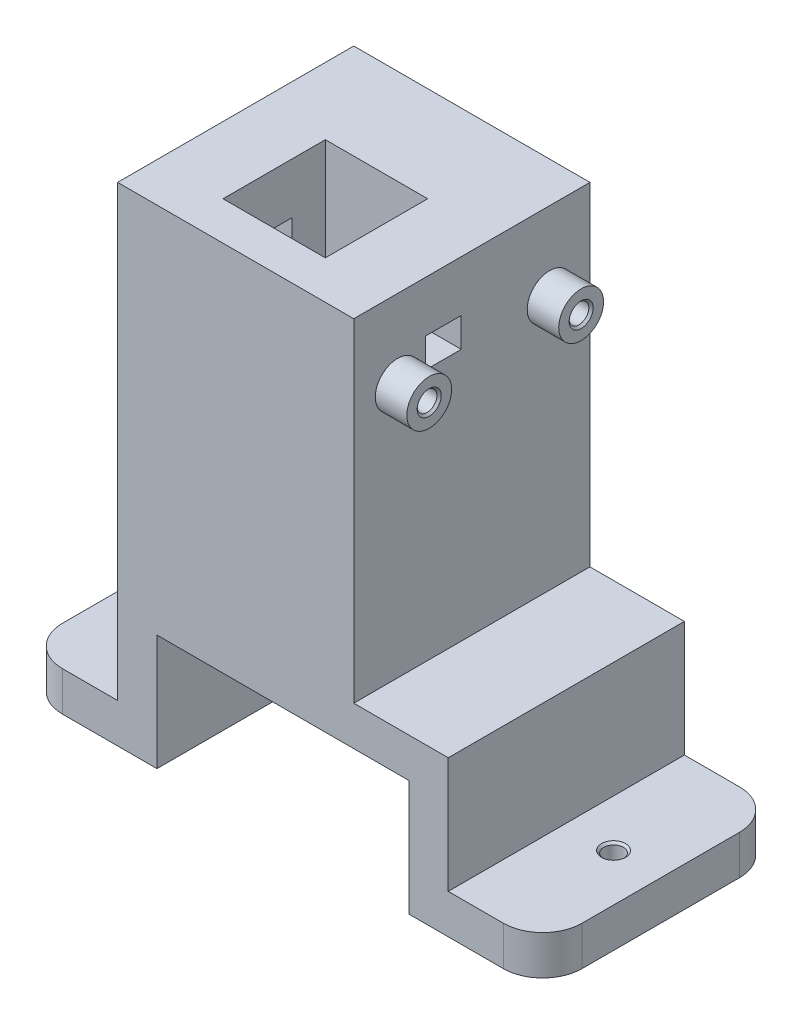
ISO-10303-21;
HEADER;
FILE_DESCRIPTION(('STEP AP214'),'2;1');
FILE_NAME('part.step','',(''),(''),'','','');
FILE_SCHEMA(('AUTOMOTIVE_DESIGN { 1 0 10303 214 1 1 1 1 }'));
ENDSEC;
DATA;
#1=APPLICATION_CONTEXT('core data for automotive mechanical design processes');
#2=APPLICATION_PROTOCOL_DEFINITION('international standard','automotive_design',2000,#1);
#3=PRODUCT_CONTEXT('',#1,'mechanical');
#4=PRODUCT('Part','Part','',(#3));
#5=PRODUCT_RELATED_PRODUCT_CATEGORY('part','',(#4));
#6=PRODUCT_DEFINITION_FORMATION('','',#4);
#7=PRODUCT_DEFINITION_CONTEXT('part definition',#1,'design');
#8=PRODUCT_DEFINITION('design','',#6,#7);
#9=PRODUCT_DEFINITION_SHAPE('','',#8);
#10=(LENGTH_UNIT() NAMED_UNIT(*) SI_UNIT(.MILLI.,.METRE.));
#11=(NAMED_UNIT(*) PLANE_ANGLE_UNIT() SI_UNIT($,.RADIAN.));
#12=(NAMED_UNIT(*) SI_UNIT($,.STERADIAN.) SOLID_ANGLE_UNIT());
#13=UNCERTAINTY_MEASURE_WITH_UNIT(LENGTH_MEASURE(1.E-05),#10,'distance_accuracy_value','');
#14=(GEOMETRIC_REPRESENTATION_CONTEXT(3) GLOBAL_UNCERTAINTY_ASSIGNED_CONTEXT((#13)) GLOBAL_UNIT_ASSIGNED_CONTEXT((#10,
#11,#12)) REPRESENTATION_CONTEXT('',''));
#15=CARTESIAN_POINT('',(0.,0.,0.));
#16=DIRECTION('',(0.,0.,1.));
#17=DIRECTION('',(1.,0.,0.));
#18=AXIS2_PLACEMENT_3D('',#15,#16,#17);
#19=CARTESIAN_POINT('',(-17.5352823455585,24.5628506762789,30.));
#20=DIRECTION('',(1.,0.,0.));
#21=DIRECTION('',(0.,1.,0.));
#22=AXIS2_PLACEMENT_3D('',#19,#20,#21);
#23=PLANE('',#22);
#24=DIRECTION('',(0.,0.,-1.));
#25=VECTOR('',#24,1.);
#26=CARTESIAN_POINT('',(-17.5352823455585,18.0992984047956,30.));
#27=LINE('',#26,#25);
#28=CARTESIAN_POINT('',(-17.5352823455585,18.0992984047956,20.8723608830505));
#29=VERTEX_POINT('',#28);
#30=CARTESIAN_POINT('',(-17.5352823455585,18.0992984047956,16.3476391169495));
#31=VERTEX_POINT('',#30);
#32=EDGE_CURVE('E332',#29,#31,#27,.T.);
#33=ORIENTED_EDGE('',*,*,#32,.F.);
#34=DIRECTION('',(0.,-1.,0.));
#35=VECTOR('',#34,1.);
#36=CARTESIAN_POINT('',(-17.5352823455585,24.5628506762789,20.8723608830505));
#37=LINE('',#36,#35);
#38=CARTESIAN_POINT('',(-17.5352823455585,14.3664029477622,20.8723608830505));
#39=VERTEX_POINT('',#38);
#40=EDGE_CURVE('E337',#29,#39,#37,.T.);
#41=ORIENTED_EDGE('',*,*,#40,.T.);
#42=DIRECTION('',(0.,0.,-1.));
#43=VECTOR('',#42,1.);
#44=CARTESIAN_POINT('',(-17.5352823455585,14.3664029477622,30.));
#45=LINE('',#44,#43);
#46=CARTESIAN_POINT('',(-17.5352823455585,14.3664029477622,16.3476391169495));
#47=VERTEX_POINT('',#46);
#48=EDGE_CURVE('E321',#39,#47,#45,.T.);
#49=ORIENTED_EDGE('',*,*,#48,.T.);
#50=DIRECTION('',(0.,-1.,0.));
#51=VECTOR('',#50,1.);
#52=CARTESIAN_POINT('',(-17.5352823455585,24.5628506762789,16.3476391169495));
#53=LINE('',#52,#51);
#54=EDGE_CURVE('E327',#31,#47,#53,.T.);
#55=ORIENTED_EDGE('',*,*,#54,.F.);
#56=EDGE_LOOP('',(#33,#41,#49,#55));
#57=FACE_BOUND('',#56,.T.);
#58=DIRECTION('',(0.,-1.,0.));
#59=VECTOR('',#58,1.);
#60=CARTESIAN_POINT('',(-17.5352823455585,24.5628506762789,0.));
#61=LINE('',#60,#59);
#62=CARTESIAN_POINT('',(-17.5352823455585,24.5628506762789,0.));
#63=VERTEX_POINT('',#62);
#64=CARTESIAN_POINT('',(-17.5352823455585,-32.4371493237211,0.));
#65=VERTEX_POINT('',#64);
#66=EDGE_CURVE('E378',#63,#65,#61,.T.);
#67=ORIENTED_EDGE('',*,*,#66,.T.);
#68=DIRECTION('',(0.,0.,-1.));
#69=VECTOR('',#68,1.);
#70=CARTESIAN_POINT('',(-17.5352823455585,-32.4371493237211,30.));
#71=LINE('',#70,#69);
#72=CARTESIAN_POINT('',(-17.5352823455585,-32.4371493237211,30.));
#73=VERTEX_POINT('',#72);
#74=EDGE_CURVE('E469',#73,#65,#71,.T.);
#75=ORIENTED_EDGE('',*,*,#74,.F.);
#76=DIRECTION('',(0.,-1.,0.));
#77=VECTOR('',#76,1.);
#78=CARTESIAN_POINT('',(-17.5352823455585,24.5628506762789,30.));
#79=LINE('',#78,#77);
#80=CARTESIAN_POINT('',(-17.5352823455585,24.5628506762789,30.));
#81=VERTEX_POINT('',#80);
#82=EDGE_CURVE('E379',#81,#73,#79,.T.);
#83=ORIENTED_EDGE('',*,*,#82,.F.);
#84=DIRECTION('',(0.,0.,-1.));
#85=VECTOR('',#84,1.);
#86=CARTESIAN_POINT('',(-17.5352823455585,24.5628506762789,30.));
#87=LINE('',#86,#85);
#88=EDGE_CURVE('E407',#81,#63,#87,.T.);
#89=ORIENTED_EDGE('',*,*,#88,.T.);
#90=EDGE_LOOP('',(#67,#75,#83,#89));
#91=FACE_BOUND('',#90,.T.);
#92=ADVANCED_FACE('F49',(#57,#91),#23,.F.);
#93=CARTESIAN_POINT('',(-17.5352823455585,-32.4371493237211,30.));
#94=DIRECTION('',(0.,-1.,0.));
#95=DIRECTION('',(1.,0.,0.));
#96=AXIS2_PLACEMENT_3D('',#93,#94,#95);
#97=PLANE('',#96);
#98=CARTESIAN_POINT('',(-23.5352823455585,-32.4371493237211,15.));
#99=DIRECTION('',(0.,1.,0.));
#100=DIRECTION('',(0.,0.,1.));
#101=AXIS2_PLACEMENT_3D('',#98,#99,#100);
#102=CIRCLE('',#101,1.525);
#103=CARTESIAN_POINT('',(-23.5352823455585,-32.4371493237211,16.525));
#104=VERTEX_POINT('',#103);
#105=EDGE_CURVE('E276',#104,#104,#102,.T.);
#106=ORIENTED_EDGE('',*,*,#105,.F.);
#107=EDGE_LOOP('',(#106));
#108=FACE_BOUND('',#107,.T.);
#109=DIRECTION('',(0.,0.,-1.));
#110=VECTOR('',#109,1.);
#111=CARTESIAN_POINT('',(-29.5352823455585,-32.4371493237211,30.));
#112=LINE('',#111,#110);
#113=CARTESIAN_POINT('',(-29.5352823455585,-32.4371493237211,25.));
#114=VERTEX_POINT('',#113);
#115=CARTESIAN_POINT('',(-29.5352823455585,-32.4371493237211,5.));
#116=VERTEX_POINT('',#115);
#117=EDGE_CURVE('E467',#114,#116,#112,.T.);
#118=ORIENTED_EDGE('',*,*,#117,.F.);
#119=CARTESIAN_POINT('',(-24.5352823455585,-32.4371493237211,25.));
#120=DIRECTION('',(0.,-1.,0.));
#121=DIRECTION('',(1.,0.,0.));
#122=AXIS2_PLACEMENT_3D('',#119,#120,#121);
#123=CIRCLE('',#122,5.);
#124=CARTESIAN_POINT('',(-24.5352823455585,-32.4371493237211,30.));
#125=VERTEX_POINT('',#124);
#126=EDGE_CURVE('E11',#114,#125,#123,.F.);
#127=ORIENTED_EDGE('',*,*,#126,.T.);
#128=DIRECTION('',(-1.,0.,0.));
#129=VECTOR('',#128,1.);
#130=CARTESIAN_POINT('',(-17.5352823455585,-32.4371493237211,30.));
#131=LINE('',#130,#129);
#132=EDGE_CURVE('E382',#73,#125,#131,.T.);
#133=ORIENTED_EDGE('',*,*,#132,.F.);
#134=ORIENTED_EDGE('',*,*,#74,.T.);
#135=DIRECTION('',(-1.,0.,0.));
#136=VECTOR('',#135,1.);
#137=CARTESIAN_POINT('',(-17.5352823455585,-32.4371493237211,0.));
#138=LINE('',#137,#136);
#139=CARTESIAN_POINT('',(-24.5352823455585,-32.4371493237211,0.));
#140=VERTEX_POINT('',#139);
#141=EDGE_CURVE('E410',#65,#140,#138,.T.);
#142=ORIENTED_EDGE('',*,*,#141,.T.);
#143=CARTESIAN_POINT('',(-24.5352823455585,-32.4371493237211,5.));
#144=DIRECTION('',(0.,-1.,0.));
#145=DIRECTION('',(1.,0.,0.));
#146=AXIS2_PLACEMENT_3D('',#143,#144,#145);
#147=CIRCLE('',#146,5.);
#148=EDGE_CURVE('E57',#140,#116,#147,.F.);
#149=ORIENTED_EDGE('',*,*,#148,.T.);
#150=EDGE_LOOP('',(#118,#127,#133,#134,#142,#149));
#151=FACE_BOUND('',#150,.T.);
#152=ADVANCED_FACE('F534',(#108,#151),#97,.F.);
#153=CARTESIAN_POINT('',(-29.5352823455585,-32.4371493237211,30.));
#154=DIRECTION('',(1.,0.,0.));
#155=DIRECTION('',(0.,0.,-1.));
#156=AXIS2_PLACEMENT_3D('',#153,#154,#155);
#157=PLANE('',#156);
#158=DIRECTION('',(0.,0.,-1.));
#159=VECTOR('',#158,1.);
#160=CARTESIAN_POINT('',(-29.5352823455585,-37.4371493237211,30.));
#161=LINE('',#160,#159);
#162=CARTESIAN_POINT('',(-29.5352823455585,-37.4371493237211,25.));
#163=VERTEX_POINT('',#162);
#164=CARTESIAN_POINT('',(-29.5352823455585,-37.4371493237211,5.));
#165=VERTEX_POINT('',#164);
#166=EDGE_CURVE('E464',#163,#165,#161,.T.);
#167=ORIENTED_EDGE('',*,*,#166,.F.);
#168=DIRECTION('',(0.,-1.,0.));
#169=VECTOR('',#168,1.);
#170=CARTESIAN_POINT('',(-29.5352823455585,-32.4371493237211,25.));
#171=LINE('',#170,#169);
#172=EDGE_CURVE('E70',#163,#114,#171,.F.);
#173=ORIENTED_EDGE('',*,*,#172,.T.);
#174=ORIENTED_EDGE('',*,*,#117,.T.);
#175=DIRECTION('',(0.,-1.,0.));
#176=VECTOR('',#175,1.);
#177=CARTESIAN_POINT('',(-29.5352823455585,-37.4371493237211,5.));
#178=LINE('',#177,#176);
#179=EDGE_CURVE('E515',#116,#165,#178,.T.);
#180=ORIENTED_EDGE('',*,*,#179,.T.);
#181=EDGE_LOOP('',(#167,#173,#174,#180));
#182=FACE_BOUND('',#181,.T.);
#183=ADVANCED_FACE('F519',(#182),#157,.F.);
#184=CARTESIAN_POINT('',(-29.5352823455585,-37.4371493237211,30.));
#185=DIRECTION('',(0.,1.,0.));
#186=DIRECTION('',(-1.,0.,0.));
#187=AXIS2_PLACEMENT_3D('',#184,#185,#186);
#188=PLANE('',#187);
#189=CARTESIAN_POINT('',(-23.5352823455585,-37.4371493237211,15.));
#190=DIRECTION('',(0.,1.,0.));
#191=DIRECTION('',(0.,0.,1.));
#192=AXIS2_PLACEMENT_3D('',#189,#190,#191);
#193=CIRCLE('',#192,1.25);
#194=CARTESIAN_POINT('',(-23.5352823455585,-37.4371493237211,16.25));
#195=VERTEX_POINT('',#194);
#196=EDGE_CURVE('E282',#195,#195,#193,.T.);
#197=ORIENTED_EDGE('',*,*,#196,.T.);
#198=EDGE_LOOP('',(#197));
#199=FACE_BOUND('',#198,.T.);
#200=DIRECTION('',(1.,0.,0.));
#201=VECTOR('',#200,1.);
#202=CARTESIAN_POINT('',(-29.5352823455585,-37.4371493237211,30.));
#203=LINE('',#202,#201);
#204=CARTESIAN_POINT('',(-24.5352823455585,-37.4371493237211,30.));
#205=VERTEX_POINT('',#204);
#206=CARTESIAN_POINT('',(-12.5352823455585,-37.4371493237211,30.));
#207=VERTEX_POINT('',#206);
#208=EDGE_CURVE('E386',#205,#207,#203,.T.);
#209=ORIENTED_EDGE('',*,*,#208,.F.);
#210=CARTESIAN_POINT('',(-24.5352823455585,-37.4371493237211,25.));
#211=DIRECTION('',(0.,1.,0.));
#212=DIRECTION('',(-1.,0.,0.));
#213=AXIS2_PLACEMENT_3D('',#210,#211,#212);
#214=CIRCLE('',#213,5.);
#215=EDGE_CURVE('E513',#205,#163,#214,.F.);
#216=ORIENTED_EDGE('',*,*,#215,.T.);
#217=ORIENTED_EDGE('',*,*,#166,.T.);
#218=CARTESIAN_POINT('',(-24.5352823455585,-37.4371493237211,5.));
#219=DIRECTION('',(0.,1.,0.));
#220=DIRECTION('',(-1.,0.,0.));
#221=AXIS2_PLACEMENT_3D('',#218,#219,#220);
#222=CIRCLE('',#221,5.);
#223=CARTESIAN_POINT('',(-24.5352823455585,-37.4371493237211,0.));
#224=VERTEX_POINT('',#223);
#225=EDGE_CURVE('E511',#165,#224,#222,.F.);
#226=ORIENTED_EDGE('',*,*,#225,.T.);
#227=DIRECTION('',(1.,0.,0.));
#228=VECTOR('',#227,1.);
#229=CARTESIAN_POINT('',(-29.5352823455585,-37.4371493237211,0.));
#230=LINE('',#229,#228);
#231=CARTESIAN_POINT('',(-12.5352823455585,-37.4371493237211,0.));
#232=VERTEX_POINT('',#231);
#233=EDGE_CURVE('E412',#224,#232,#230,.T.);
#234=ORIENTED_EDGE('',*,*,#233,.T.);
#235=DIRECTION('',(0.,0.,-1.));
#236=VECTOR('',#235,1.);
#237=CARTESIAN_POINT('',(-12.5352823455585,-37.4371493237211,30.));
#238=LINE('',#237,#236);
#239=EDGE_CURVE('E461',#207,#232,#238,.T.);
#240=ORIENTED_EDGE('',*,*,#239,.F.);
#241=EDGE_LOOP('',(#209,#216,#217,#226,#234,#240));
#242=FACE_BOUND('',#241,.T.);
#243=ADVANCED_FACE('F523',(#199,#242),#188,.F.);
#244=CARTESIAN_POINT('',(-12.5352823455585,-37.4371493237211,30.));
#245=DIRECTION('',(-1.,0.,0.));
#246=DIRECTION('',(0.,-1.,0.));
#247=AXIS2_PLACEMENT_3D('',#244,#245,#246);
#248=PLANE('',#247);
#249=DIRECTION('',(0.,1.,0.));
#250=VECTOR('',#249,1.);
#251=CARTESIAN_POINT('',(-12.5352823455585,-37.4371493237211,0.));
#252=LINE('',#251,#250);
#253=CARTESIAN_POINT('',(-12.5352823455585,-22.7371493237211,0.));
#254=VERTEX_POINT('',#253);
#255=EDGE_CURVE('E414',#232,#254,#252,.T.);
#256=ORIENTED_EDGE('',*,*,#255,.T.);
#257=DIRECTION('',(0.,0.,-1.));
#258=VECTOR('',#257,1.);
#259=CARTESIAN_POINT('',(-12.5352823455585,-22.7371493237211,30.));
#260=LINE('',#259,#258);
#261=CARTESIAN_POINT('',(-12.5352823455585,-22.7371493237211,30.));
#262=VERTEX_POINT('',#261);
#263=EDGE_CURVE('E458',#262,#254,#260,.T.);
#264=ORIENTED_EDGE('',*,*,#263,.F.);
#265=DIRECTION('',(0.,1.,0.));
#266=VECTOR('',#265,1.);
#267=CARTESIAN_POINT('',(-12.5352823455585,-37.4371493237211,30.));
#268=LINE('',#267,#266);
#269=EDGE_CURVE('E388',#207,#262,#268,.T.);
#270=ORIENTED_EDGE('',*,*,#269,.F.);
#271=ORIENTED_EDGE('',*,*,#239,.T.);
#272=EDGE_LOOP('',(#256,#264,#270,#271));
#273=FACE_BOUND('',#272,.T.);
#274=ADVANCED_FACE('F646',(#273),#248,.F.);
#275=CARTESIAN_POINT('',(-12.5352823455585,-22.7371493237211,30.));
#276=DIRECTION('',(0.,1.,0.));
#277=DIRECTION('',(-1.,0.,0.));
#278=AXIS2_PLACEMENT_3D('',#275,#276,#277);
#279=PLANE('',#278);
#280=DIRECTION('',(1.,0.,0.));
#281=VECTOR('',#280,1.);
#282=CARTESIAN_POINT('',(-12.5352823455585,-22.7371493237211,0.));
#283=LINE('',#282,#281);
#284=CARTESIAN_POINT('',(19.4647176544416,-22.7371493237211,0.));
#285=VERTEX_POINT('',#284);
#286=EDGE_CURVE('E416',#254,#285,#283,.T.);
#287=ORIENTED_EDGE('',*,*,#286,.T.);
#288=DIRECTION('',(0.,0.,-1.));
#289=VECTOR('',#288,1.);
#290=CARTESIAN_POINT('',(19.4647176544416,-22.7371493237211,30.));
#291=LINE('',#290,#289);
#292=CARTESIAN_POINT('',(19.4647176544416,-22.7371493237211,30.));
#293=VERTEX_POINT('',#292);
#294=EDGE_CURVE('E455',#293,#285,#291,.T.);
#295=ORIENTED_EDGE('',*,*,#294,.F.);
#296=DIRECTION('',(1.,0.,0.));
#297=VECTOR('',#296,1.);
#298=CARTESIAN_POINT('',(-12.5352823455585,-22.7371493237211,30.));
#299=LINE('',#298,#297);
#300=EDGE_CURVE('E390',#262,#293,#299,.T.);
#301=ORIENTED_EDGE('',*,*,#300,.F.);
#302=ORIENTED_EDGE('',*,*,#263,.T.);
#303=EDGE_LOOP('',(#287,#295,#301,#302));
#304=FACE_BOUND('',#303,.T.);
#305=ADVANCED_FACE('F643',(#304),#279,.F.);
#306=CARTESIAN_POINT('',(19.4647176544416,-37.4371493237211,30.));
#307=DIRECTION('',(1.,0.,0.));
#308=DIRECTION('',(0.,0.,-1.));
#309=AXIS2_PLACEMENT_3D('',#306,#307,#308);
#310=PLANE('',#309);
#311=DIRECTION('',(0.,-1.,0.));
#312=VECTOR('',#311,1.);
#313=CARTESIAN_POINT('',(19.4647176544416,-37.4371493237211,0.));
#314=LINE('',#313,#312);
#315=CARTESIAN_POINT('',(19.4647176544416,-37.4371493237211,0.));
#316=VERTEX_POINT('',#315);
#317=EDGE_CURVE('E418',#285,#316,#314,.T.);
#318=ORIENTED_EDGE('',*,*,#317,.T.);
#319=DIRECTION('',(0.,0.,-1.));
#320=VECTOR('',#319,1.);
#321=CARTESIAN_POINT('',(19.4647176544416,-37.4371493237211,30.));
#322=LINE('',#321,#320);
#323=CARTESIAN_POINT('',(19.4647176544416,-37.4371493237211,30.));
#324=VERTEX_POINT('',#323);
#325=EDGE_CURVE('E452',#324,#316,#322,.T.);
#326=ORIENTED_EDGE('',*,*,#325,.F.);
#327=DIRECTION('',(0.,-1.,0.));
#328=VECTOR('',#327,1.);
#329=CARTESIAN_POINT('',(19.4647176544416,-37.4371493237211,30.));
#330=LINE('',#329,#328);
#331=EDGE_CURVE('E392',#293,#324,#330,.T.);
#332=ORIENTED_EDGE('',*,*,#331,.F.);
#333=ORIENTED_EDGE('',*,*,#294,.T.);
#334=EDGE_LOOP('',(#318,#326,#332,#333));
#335=FACE_BOUND('',#334,.T.);
#336=ADVANCED_FACE('F585',(#335),#310,.F.);
#337=CARTESIAN_POINT('',(19.4647176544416,-37.4371493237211,30.));
#338=DIRECTION('',(0.,1.,0.));
#339=DIRECTION('',(0.,0.,1.));
#340=AXIS2_PLACEMENT_3D('',#337,#338,#339);
#341=PLANE('',#340);
#342=CARTESIAN_POINT('',(30.4647176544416,-37.4371493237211,15.));
#343=DIRECTION('',(0.,1.,0.));
#344=DIRECTION('',(0.,0.,1.));
#345=AXIS2_PLACEMENT_3D('',#342,#343,#344);
#346=CIRCLE('',#345,1.25);
#347=CARTESIAN_POINT('',(30.4647176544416,-37.4371493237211,16.25));
#348=VERTEX_POINT('',#347);
#349=EDGE_CURVE('E291',#348,#348,#346,.T.);
#350=ORIENTED_EDGE('',*,*,#349,.T.);
#351=EDGE_LOOP('',(#350));
#352=FACE_BOUND('',#351,.T.);
#353=DIRECTION('',(1.,0.,0.));
#354=VECTOR('',#353,1.);
#355=CARTESIAN_POINT('',(19.4647176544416,-37.4371493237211,0.));
#356=LINE('',#355,#354);
#357=CARTESIAN_POINT('',(31.4647176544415,-37.4371493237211,0.));
#358=VERTEX_POINT('',#357);
#359=EDGE_CURVE('E420',#316,#358,#356,.T.);
#360=ORIENTED_EDGE('',*,*,#359,.T.);
#361=CARTESIAN_POINT('',(31.4647176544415,-37.4371493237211,5.));
#362=DIRECTION('',(0.,1.,0.));
#363=DIRECTION('',(0.,0.,1.));
#364=AXIS2_PLACEMENT_3D('',#361,#362,#363);
#365=CIRCLE('',#364,5.);
#366=CARTESIAN_POINT('',(36.4647176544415,-37.4371493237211,5.));
#367=VERTEX_POINT('',#366);
#368=EDGE_CURVE('E503',#358,#367,#365,.F.);
#369=ORIENTED_EDGE('',*,*,#368,.T.);
#370=DIRECTION('',(0.,0.,-1.));
#371=VECTOR('',#370,1.);
#372=CARTESIAN_POINT('',(36.4647176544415,-37.4371493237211,30.));
#373=LINE('',#372,#371);
#374=CARTESIAN_POINT('',(36.4647176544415,-37.4371493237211,25.));
#375=VERTEX_POINT('',#374);
#376=EDGE_CURVE('E449',#375,#367,#373,.T.);
#377=ORIENTED_EDGE('',*,*,#376,.F.);
#378=CARTESIAN_POINT('',(31.4647176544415,-37.4371493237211,25.));
#379=DIRECTION('',(0.,1.,0.));
#380=DIRECTION('',(0.,0.,1.));
#381=AXIS2_PLACEMENT_3D('',#378,#379,#380);
#382=CIRCLE('',#381,5.);
#383=CARTESIAN_POINT('',(31.4647176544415,-37.4371493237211,30.));
#384=VERTEX_POINT('',#383);
#385=EDGE_CURVE('E501',#375,#384,#382,.F.);
#386=ORIENTED_EDGE('',*,*,#385,.T.);
#387=DIRECTION('',(1.,0.,0.));
#388=VECTOR('',#387,1.);
#389=CARTESIAN_POINT('',(19.4647176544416,-37.4371493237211,30.));
#390=LINE('',#389,#388);
#391=EDGE_CURVE('E394',#324,#384,#390,.T.);
#392=ORIENTED_EDGE('',*,*,#391,.F.);
#393=ORIENTED_EDGE('',*,*,#325,.T.);
#394=EDGE_LOOP('',(#360,#369,#377,#386,#392,#393));
#395=FACE_BOUND('',#394,.T.);
#396=ADVANCED_FACE('F578',(#352,#395),#341,.F.);
#397=CARTESIAN_POINT('',(36.4647176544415,-32.4371493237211,30.));
#398=DIRECTION('',(-1.,0.,0.));
#399=DIRECTION('',(0.,0.,1.));
#400=AXIS2_PLACEMENT_3D('',#397,#398,#399);
#401=PLANE('',#400);
#402=ORIENTED_EDGE('',*,*,#376,.T.);
#403=DIRECTION('',(0.,1.,0.));
#404=VECTOR('',#403,1.);
#405=CARTESIAN_POINT('',(36.4647176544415,-32.4371493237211,5.));
#406=LINE('',#405,#404);
#407=CARTESIAN_POINT('',(36.4647176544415,-32.4371493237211,5.));
#408=VERTEX_POINT('',#407);
#409=EDGE_CURVE('E490',#367,#408,#406,.T.);
#410=ORIENTED_EDGE('',*,*,#409,.T.);
#411=DIRECTION('',(0.,0.,-1.));
#412=VECTOR('',#411,1.);
#413=CARTESIAN_POINT('',(36.4647176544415,-32.4371493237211,30.));
#414=LINE('',#413,#412);
#415=CARTESIAN_POINT('',(36.4647176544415,-32.4371493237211,25.));
#416=VERTEX_POINT('',#415);
#417=EDGE_CURVE('E446',#416,#408,#414,.T.);
#418=ORIENTED_EDGE('',*,*,#417,.F.);
#419=DIRECTION('',(0.,1.,0.));
#420=VECTOR('',#419,1.);
#421=CARTESIAN_POINT('',(36.4647176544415,-32.4371493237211,25.));
#422=LINE('',#421,#420);
#423=EDGE_CURVE('E488',#416,#375,#422,.F.);
#424=ORIENTED_EDGE('',*,*,#423,.T.);
#425=EDGE_LOOP('',(#402,#410,#418,#424));
#426=FACE_BOUND('',#425,.T.);
#427=ADVANCED_FACE('F594',(#426),#401,.F.);
#428=CARTESIAN_POINT('',(24.4647176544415,-32.4371493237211,30.));
#429=DIRECTION('',(0.,-1.,0.));
#430=DIRECTION('',(0.,0.,-1.));
#431=AXIS2_PLACEMENT_3D('',#428,#429,#430);
#432=PLANE('',#431);
#433=CARTESIAN_POINT('',(30.4647176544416,-32.4371493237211,15.));
#434=DIRECTION('',(0.,1.,0.));
#435=DIRECTION('',(0.,0.,1.));
#436=AXIS2_PLACEMENT_3D('',#433,#434,#435);
#437=CIRCLE('',#436,1.525);
#438=CARTESIAN_POINT('',(30.4647176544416,-32.4371493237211,16.525));
#439=VERTEX_POINT('',#438);
#440=EDGE_CURVE('E285',#439,#439,#437,.T.);
#441=ORIENTED_EDGE('',*,*,#440,.F.);
#442=EDGE_LOOP('',(#441));
#443=FACE_BOUND('',#442,.T.);
#444=ORIENTED_EDGE('',*,*,#417,.T.);
#445=CARTESIAN_POINT('',(31.4647176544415,-32.4371493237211,5.));
#446=DIRECTION('',(0.,-1.,0.));
#447=DIRECTION('',(0.,0.,-1.));
#448=AXIS2_PLACEMENT_3D('',#445,#446,#447);
#449=CIRCLE('',#448,5.);
#450=CARTESIAN_POINT('',(31.4647176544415,-32.4371493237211,0.));
#451=VERTEX_POINT('',#450);
#452=EDGE_CURVE('E495',#408,#451,#449,.F.);
#453=ORIENTED_EDGE('',*,*,#452,.T.);
#454=DIRECTION('',(-1.,0.,0.));
#455=VECTOR('',#454,1.);
#456=CARTESIAN_POINT('',(24.4647176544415,-32.4371493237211,0.));
#457=LINE('',#456,#455);
#458=CARTESIAN_POINT('',(24.4647176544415,-32.4371493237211,0.));
#459=VERTEX_POINT('',#458);
#460=EDGE_CURVE('E423',#451,#459,#457,.T.);
#461=ORIENTED_EDGE('',*,*,#460,.T.);
#462=DIRECTION('',(0.,0.,-1.));
#463=VECTOR('',#462,1.);
#464=CARTESIAN_POINT('',(24.4647176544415,-32.4371493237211,30.));
#465=LINE('',#464,#463);
#466=CARTESIAN_POINT('',(24.4647176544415,-32.4371493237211,30.));
#467=VERTEX_POINT('',#466);
#468=EDGE_CURVE('E443',#467,#459,#465,.T.);
#469=ORIENTED_EDGE('',*,*,#468,.F.);
#470=DIRECTION('',(-1.,0.,0.));
#471=VECTOR('',#470,1.);
#472=CARTESIAN_POINT('',(24.4647176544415,-32.4371493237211,30.));
#473=LINE('',#472,#471);
#474=CARTESIAN_POINT('',(31.4647176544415,-32.4371493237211,30.));
#475=VERTEX_POINT('',#474);
#476=EDGE_CURVE('E397',#475,#467,#473,.T.);
#477=ORIENTED_EDGE('',*,*,#476,.F.);
#478=CARTESIAN_POINT('',(31.4647176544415,-32.4371493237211,25.));
#479=DIRECTION('',(0.,-1.,0.));
#480=DIRECTION('',(0.,0.,-1.));
#481=AXIS2_PLACEMENT_3D('',#478,#479,#480);
#482=CIRCLE('',#481,5.);
#483=EDGE_CURVE('E493',#475,#416,#482,.F.);
#484=ORIENTED_EDGE('',*,*,#483,.T.);
#485=EDGE_LOOP('',(#444,#453,#461,#469,#477,#484));
#486=FACE_BOUND('',#485,.T.);
#487=ADVANCED_FACE('F597',(#443,#486),#432,.F.);
#488=CARTESIAN_POINT('',(24.4647176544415,-17.7371493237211,30.));
#489=DIRECTION('',(-1.,0.,0.));
#490=DIRECTION('',(0.,-1.,0.));
#491=AXIS2_PLACEMENT_3D('',#488,#489,#490);
#492=PLANE('',#491);
#493=DIRECTION('',(0.,1.,0.));
#494=VECTOR('',#493,1.);
#495=CARTESIAN_POINT('',(24.4647176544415,-17.7371493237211,0.));
#496=LINE('',#495,#494);
#497=CARTESIAN_POINT('',(24.4647176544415,-17.7371493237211,0.));
#498=VERTEX_POINT('',#497);
#499=EDGE_CURVE('E425',#459,#498,#496,.T.);
#500=ORIENTED_EDGE('',*,*,#499,.T.);
#501=DIRECTION('',(0.,0.,-1.));
#502=VECTOR('',#501,1.);
#503=CARTESIAN_POINT('',(24.4647176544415,-17.7371493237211,30.));
#504=LINE('',#503,#502);
#505=CARTESIAN_POINT('',(24.4647176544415,-17.7371493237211,30.));
#506=VERTEX_POINT('',#505);
#507=EDGE_CURVE('E440',#506,#498,#504,.T.);
#508=ORIENTED_EDGE('',*,*,#507,.F.);
#509=DIRECTION('',(0.,1.,0.));
#510=VECTOR('',#509,1.);
#511=CARTESIAN_POINT('',(24.4647176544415,-17.7371493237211,30.));
#512=LINE('',#511,#510);
#513=EDGE_CURVE('E399',#467,#506,#512,.T.);
#514=ORIENTED_EDGE('',*,*,#513,.F.);
#515=ORIENTED_EDGE('',*,*,#468,.T.);
#516=EDGE_LOOP('',(#500,#508,#514,#515));
#517=FACE_BOUND('',#516,.T.);
#518=ADVANCED_FACE('F604',(#517),#492,.F.);
#519=CARTESIAN_POINT('',(24.4647176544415,-17.7371493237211,30.));
#520=DIRECTION('',(0.,-1.,0.));
#521=DIRECTION('',(1.,0.,0.));
#522=AXIS2_PLACEMENT_3D('',#519,#520,#521);
#523=PLANE('',#522);
#524=DIRECTION('',(-1.,0.,0.));
#525=VECTOR('',#524,1.);
#526=CARTESIAN_POINT('',(24.4647176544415,-17.7371493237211,0.));
#527=LINE('',#526,#525);
#528=CARTESIAN_POINT('',(12.4647176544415,-17.7371493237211,0.));
#529=VERTEX_POINT('',#528);
#530=EDGE_CURVE('E427',#498,#529,#527,.T.);
#531=ORIENTED_EDGE('',*,*,#530,.T.);
#532=DIRECTION('',(0.,0.,-1.));
#533=VECTOR('',#532,1.);
#534=CARTESIAN_POINT('',(12.4647176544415,-17.7371493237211,30.));
#535=LINE('',#534,#533);
#536=CARTESIAN_POINT('',(12.4647176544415,-17.7371493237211,30.));
#537=VERTEX_POINT('',#536);
#538=EDGE_CURVE('E437',#537,#529,#535,.T.);
#539=ORIENTED_EDGE('',*,*,#538,.F.);
#540=DIRECTION('',(-1.,0.,0.));
#541=VECTOR('',#540,1.);
#542=CARTESIAN_POINT('',(24.4647176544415,-17.7371493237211,30.));
#543=LINE('',#542,#541);
#544=EDGE_CURVE('E401',#506,#537,#543,.T.);
#545=ORIENTED_EDGE('',*,*,#544,.F.);
#546=ORIENTED_EDGE('',*,*,#507,.T.);
#547=EDGE_LOOP('',(#531,#539,#545,#546));
#548=FACE_BOUND('',#547,.T.);
#549=ADVANCED_FACE('F607',(#548),#523,.F.);
#550=CARTESIAN_POINT('',(12.4647176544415,24.5628506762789,30.));
#551=DIRECTION('',(-1.,0.,0.));
#552=DIRECTION('',(0.,-1.,0.));
#553=AXIS2_PLACEMENT_3D('',#550,#551,#552);
#554=PLANE('',#553);
#555=DIRECTION('',(0.,0.,-1.));
#556=VECTOR('',#555,1.);
#557=CARTESIAN_POINT('',(12.4647176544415,14.3664029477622,20.8723608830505));
#558=LINE('',#557,#556);
#559=CARTESIAN_POINT('',(12.4647176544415,14.3664029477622,20.8723608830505));
#560=VERTEX_POINT('',#559);
#561=CARTESIAN_POINT('',(12.4647176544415,14.3664029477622,16.3476391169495));
#562=VERTEX_POINT('',#561);
#563=EDGE_CURVE('E296',#560,#562,#558,.T.);
#564=ORIENTED_EDGE('',*,*,#563,.F.);
#565=DIRECTION('',(0.,-1.,0.));
#566=VECTOR('',#565,1.);
#567=CARTESIAN_POINT('',(12.4647176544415,18.0992984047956,20.8723608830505));
#568=LINE('',#567,#566);
#569=CARTESIAN_POINT('',(12.4647176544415,18.0992984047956,20.8723608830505));
#570=VERTEX_POINT('',#569);
#571=EDGE_CURVE('E294',#570,#560,#568,.T.);
#572=ORIENTED_EDGE('',*,*,#571,.F.);
#573=DIRECTION('',(0.,0.,-1.));
#574=VECTOR('',#573,1.);
#575=CARTESIAN_POINT('',(12.4647176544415,18.0992984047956,20.8723608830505));
#576=LINE('',#575,#574);
#577=CARTESIAN_POINT('',(12.4647176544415,18.0992984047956,16.3476391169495));
#578=VERTEX_POINT('',#577);
#579=EDGE_CURVE('E302',#570,#578,#576,.T.);
#580=ORIENTED_EDGE('',*,*,#579,.T.);
#581=DIRECTION('',(0.,-1.,0.));
#582=VECTOR('',#581,1.);
#583=CARTESIAN_POINT('',(12.4647176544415,18.0992984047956,16.3476391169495));
#584=LINE('',#583,#582);
#585=EDGE_CURVE('E299',#578,#562,#584,.T.);
#586=ORIENTED_EDGE('',*,*,#585,.T.);
#587=EDGE_LOOP('',(#564,#572,#580,#586));
#588=FACE_BOUND('',#587,.T.);
#589=CARTESIAN_POINT('',(12.4647176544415,14.5628506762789,5.11707717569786));
#590=DIRECTION('',(-1.,0.,0.));
#591=DIRECTION('',(0.,-1.,0.));
#592=AXIS2_PLACEMENT_3D('',#589,#590,#591);
#593=CIRCLE('',#592,2.85);
#594=CARTESIAN_POINT('',(12.4647176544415,11.7128506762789,5.11707717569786));
#595=VERTEX_POINT('',#594);
#596=EDGE_CURVE('E475',#595,#595,#593,.F.);
#597=ORIENTED_EDGE('',*,*,#596,.F.);
#598=EDGE_LOOP('',(#597));
#599=FACE_BOUND('',#598,.T.);
#600=CARTESIAN_POINT('',(12.4647176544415,14.5628506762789,24.4170771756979));
#601=DIRECTION('',(-1.,0.,0.));
#602=DIRECTION('',(0.,-1.,0.));
#603=AXIS2_PLACEMENT_3D('',#600,#601,#602);
#604=CIRCLE('',#603,2.85);
#605=CARTESIAN_POINT('',(12.4647176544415,11.7128506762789,24.4170771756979));
#606=VERTEX_POINT('',#605);
#607=EDGE_CURVE('E472',#606,#606,#604,.F.);
#608=ORIENTED_EDGE('',*,*,#607,.F.);
#609=EDGE_LOOP('',(#608));
#610=FACE_BOUND('',#609,.T.);
#611=DIRECTION('',(0.,1.,0.));
#612=VECTOR('',#611,1.);
#613=CARTESIAN_POINT('',(12.4647176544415,24.5628506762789,0.));
#614=LINE('',#613,#612);
#615=CARTESIAN_POINT('',(12.4647176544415,24.5628506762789,0.));
#616=VERTEX_POINT('',#615);
#617=EDGE_CURVE('E429',#529,#616,#614,.T.);
#618=ORIENTED_EDGE('',*,*,#617,.T.);
#619=DIRECTION('',(0.,0.,-1.));
#620=VECTOR('',#619,1.);
#621=CARTESIAN_POINT('',(12.4647176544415,24.5628506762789,30.));
#622=LINE('',#621,#620);
#623=CARTESIAN_POINT('',(12.4647176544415,24.5628506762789,30.));
#624=VERTEX_POINT('',#623);
#625=EDGE_CURVE('E434',#624,#616,#622,.T.);
#626=ORIENTED_EDGE('',*,*,#625,.F.);
#627=DIRECTION('',(0.,1.,0.));
#628=VECTOR('',#627,1.);
#629=CARTESIAN_POINT('',(12.4647176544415,24.5628506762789,30.));
#630=LINE('',#629,#628);
#631=EDGE_CURVE('E403',#537,#624,#630,.T.);
#632=ORIENTED_EDGE('',*,*,#631,.F.);
#633=ORIENTED_EDGE('',*,*,#538,.T.);
#634=EDGE_LOOP('',(#618,#626,#632,#633));
#635=FACE_BOUND('',#634,.T.);
#636=ADVANCED_FACE('F611',(#588,#599,#610,#635),#554,.F.);
#637=CARTESIAN_POINT('',(-17.5352823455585,24.5628506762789,30.));
#638=DIRECTION('',(0.,-1.,0.));
#639=DIRECTION('',(1.,0.,0.));
#640=AXIS2_PLACEMENT_3D('',#637,#638,#639);
#641=PLANE('',#640);
#642=DIRECTION('',(-1.,0.,0.));
#643=VECTOR('',#642,1.);
#644=CARTESIAN_POINT('',(-9.03528234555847,24.5628506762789,12.11));
#645=LINE('',#644,#643);
#646=CARTESIAN_POINT('',(3.96471765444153,24.5628506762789,12.11));
#647=VERTEX_POINT('',#646);
#648=CARTESIAN_POINT('',(-9.03528234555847,24.5628506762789,12.11));
#649=VERTEX_POINT('',#648);
#650=EDGE_CURVE('E356',#647,#649,#645,.T.);
#651=ORIENTED_EDGE('',*,*,#650,.F.);
#652=DIRECTION('',(0.,0.,-1.));
#653=VECTOR('',#652,1.);
#654=CARTESIAN_POINT('',(3.96471765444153,24.5628506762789,12.11));
#655=LINE('',#654,#653);
#656=CARTESIAN_POINT('',(3.96471765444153,24.5628506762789,25.11));
#657=VERTEX_POINT('',#656);
#658=EDGE_CURVE('E340',#657,#647,#655,.T.);
#659=ORIENTED_EDGE('',*,*,#658,.F.);
#660=DIRECTION('',(1.,0.,0.));
#661=VECTOR('',#660,1.);
#662=CARTESIAN_POINT('',(-9.03528234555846,24.5628506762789,25.11));
#663=LINE('',#662,#661);
#664=CARTESIAN_POINT('',(-9.03528234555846,24.5628506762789,25.11));
#665=VERTEX_POINT('',#664);
#666=EDGE_CURVE('E345',#665,#657,#663,.T.);
#667=ORIENTED_EDGE('',*,*,#666,.F.);
#668=DIRECTION('',(0.,0.,1.));
#669=VECTOR('',#668,1.);
#670=CARTESIAN_POINT('',(-9.03528234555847,24.5628506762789,12.11));
#671=LINE('',#670,#669);
#672=EDGE_CURVE('E359',#649,#665,#671,.T.);
#673=ORIENTED_EDGE('',*,*,#672,.F.);
#674=EDGE_LOOP('',(#651,#659,#667,#673));
#675=FACE_BOUND('',#674,.T.);
#676=DIRECTION('',(-1.,0.,0.));
#677=VECTOR('',#676,1.);
#678=CARTESIAN_POINT('',(-17.5352823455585,24.5628506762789,0.));
#679=LINE('',#678,#677);
#680=EDGE_CURVE('E383',#616,#63,#679,.T.);
#681=ORIENTED_EDGE('',*,*,#680,.T.);
#682=ORIENTED_EDGE('',*,*,#88,.F.);
#683=DIRECTION('',(-1.,0.,0.));
#684=VECTOR('',#683,1.);
#685=CARTESIAN_POINT('',(-17.5352823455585,24.5628506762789,30.));
#686=LINE('',#685,#684);
#687=EDGE_CURVE('E405',#624,#81,#686,.T.);
#688=ORIENTED_EDGE('',*,*,#687,.F.);
#689=ORIENTED_EDGE('',*,*,#625,.T.);
#690=EDGE_LOOP('',(#681,#682,#688,#689));
#691=FACE_BOUND('',#690,.T.);
#692=ADVANCED_FACE('F614',(#675,#691),#641,.F.);
#693=CARTESIAN_POINT('',(0.,0.,30.));
#694=DIRECTION('',(0.,0.,-1.));
#695=DIRECTION('',(-1.,0.,0.));
#696=AXIS2_PLACEMENT_3D('',#693,#694,#695);
#697=PLANE('',#696);
#698=ORIENTED_EDGE('',*,*,#391,.T.);
#699=DIRECTION('',(0.,1.,0.));
#700=VECTOR('',#699,1.);
#701=CARTESIAN_POINT('',(31.4647176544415,0.,30.));
#702=LINE('',#701,#700);
#703=EDGE_CURVE('E508',#384,#475,#702,.T.);
#704=ORIENTED_EDGE('',*,*,#703,.T.);
#705=ORIENTED_EDGE('',*,*,#476,.T.);
#706=ORIENTED_EDGE('',*,*,#513,.T.);
#707=ORIENTED_EDGE('',*,*,#544,.T.);
#708=ORIENTED_EDGE('',*,*,#631,.T.);
#709=ORIENTED_EDGE('',*,*,#687,.T.);
#710=ORIENTED_EDGE('',*,*,#82,.T.);
#711=ORIENTED_EDGE('',*,*,#132,.T.);
#712=DIRECTION('',(0.,-1.,0.));
#713=VECTOR('',#712,1.);
#714=CARTESIAN_POINT('',(-24.5352823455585,0.,30.));
#715=LINE('',#714,#713);
#716=EDGE_CURVE('E505',#125,#205,#715,.T.);
#717=ORIENTED_EDGE('',*,*,#716,.T.);
#718=ORIENTED_EDGE('',*,*,#208,.T.);
#719=ORIENTED_EDGE('',*,*,#269,.T.);
#720=ORIENTED_EDGE('',*,*,#300,.T.);
#721=ORIENTED_EDGE('',*,*,#331,.T.);
#722=EDGE_LOOP('',(#698,#704,#705,#706,#707,#708,#709,#710,#711,#717,#718,#719,#720,#721));
#723=FACE_BOUND('',#722,.T.);
#724=ADVANCED_FACE('F531',(#723),#697,.F.);
#725=CARTESIAN_POINT('',(0.,0.,0.));
#726=DIRECTION('',(0.,0.,-1.));
#727=DIRECTION('',(-1.,0.,0.));
#728=AXIS2_PLACEMENT_3D('',#725,#726,#727);
#729=PLANE('',#728);
#730=ORIENTED_EDGE('',*,*,#460,.F.);
#731=DIRECTION('',(0.,1.,0.));
#732=VECTOR('',#731,1.);
#733=CARTESIAN_POINT('',(31.4647176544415,-37.4371493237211,0.));
#734=LINE('',#733,#732);
#735=EDGE_CURVE('E499',#451,#358,#734,.F.);
#736=ORIENTED_EDGE('',*,*,#735,.T.);
#737=ORIENTED_EDGE('',*,*,#359,.F.);
#738=ORIENTED_EDGE('',*,*,#317,.F.);
#739=ORIENTED_EDGE('',*,*,#286,.F.);
#740=ORIENTED_EDGE('',*,*,#255,.F.);
#741=ORIENTED_EDGE('',*,*,#233,.F.);
#742=DIRECTION('',(0.,-1.,0.));
#743=VECTOR('',#742,1.);
#744=CARTESIAN_POINT('',(-24.5352823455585,-32.4371493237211,0.));
#745=LINE('',#744,#743);
#746=EDGE_CURVE('E497',#224,#140,#745,.F.);
#747=ORIENTED_EDGE('',*,*,#746,.T.);
#748=ORIENTED_EDGE('',*,*,#141,.F.);
#749=ORIENTED_EDGE('',*,*,#66,.F.);
#750=ORIENTED_EDGE('',*,*,#680,.F.);
#751=ORIENTED_EDGE('',*,*,#617,.F.);
#752=ORIENTED_EDGE('',*,*,#530,.F.);
#753=ORIENTED_EDGE('',*,*,#499,.F.);
#754=EDGE_LOOP('',(#730,#736,#737,#738,#739,#740,#741,#747,#748,#749,#750,#751,#752,#753));
#755=FACE_BOUND('',#754,.T.);
#756=ADVANCED_FACE('F541',(#755),#729,.T.);
#757=CARTESIAN_POINT('',(16.4647176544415,14.5628506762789,24.4170771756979));
#758=DIRECTION('',(-1.,0.,0.));
#759=DIRECTION('',(0.,-1.,0.));
#760=AXIS2_PLACEMENT_3D('',#757,#758,#759);
#761=CYLINDRICAL_SURFACE('',#760,2.85);
#762=CARTESIAN_POINT('',(16.4647176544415,14.5628506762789,24.4170771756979));
#763=DIRECTION('',(1.,0.,0.));
#764=DIRECTION('',(0.,1.,0.));
#765=AXIS2_PLACEMENT_3D('',#762,#763,#764);
#766=CIRCLE('',#765,2.85);
#767=CARTESIAN_POINT('',(16.4647176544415,17.4128506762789,24.4170771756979));
#768=VERTEX_POINT('',#767);
#769=EDGE_CURVE('E375',#768,#768,#766,.T.);
#770=ORIENTED_EDGE('',*,*,#769,.F.);
#771=EDGE_LOOP('',(#770));
#772=FACE_BOUND('',#771,.T.);
#773=ORIENTED_EDGE('',*,*,#607,.T.);
#774=EDGE_LOOP('',(#773));
#775=FACE_BOUND('',#774,.T.);
#776=ADVANCED_FACE('F693',(#772,#775),#761,.T.);
#777=CARTESIAN_POINT('',(16.4647176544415,14.5628506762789,24.4170771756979));
#778=DIRECTION('',(1.,0.,0.));
#779=DIRECTION('',(0.,1.,0.));
#780=AXIS2_PLACEMENT_3D('',#777,#778,#779);
#781=PLANE('',#780);
#782=CARTESIAN_POINT('',(16.4647176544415,14.5628506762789,24.4170771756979));
#783=DIRECTION('',(1.,0.,0.));
#784=DIRECTION('',(0.,0.,-1.));
#785=AXIS2_PLACEMENT_3D('',#782,#783,#784);
#786=CIRCLE('',#785,1.525);
#787=CARTESIAN_POINT('',(16.4647176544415,14.5628506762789,22.8920771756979));
#788=VERTEX_POINT('',#787);
#789=EDGE_CURVE('E267',#788,#788,#786,.T.);
#790=ORIENTED_EDGE('',*,*,#789,.F.);
#791=EDGE_LOOP('',(#790));
#792=FACE_BOUND('',#791,.T.);
#793=ORIENTED_EDGE('',*,*,#769,.T.);
#794=EDGE_LOOP('',(#793));
#795=FACE_BOUND('',#794,.T.);
#796=ADVANCED_FACE('F957',(#792,#795),#781,.T.);
#797=CARTESIAN_POINT('',(16.4647176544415,14.5628506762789,5.11707717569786));
#798=DIRECTION('',(-1.,0.,0.));
#799=DIRECTION('',(0.,-1.,0.));
#800=AXIS2_PLACEMENT_3D('',#797,#798,#799);
#801=CYLINDRICAL_SURFACE('',#800,2.85);
#802=CARTESIAN_POINT('',(16.4647176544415,14.5628506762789,5.11707717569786));
#803=DIRECTION('',(1.,0.,0.));
#804=DIRECTION('',(0.,-1.,0.));
#805=AXIS2_PLACEMENT_3D('',#802,#803,#804);
#806=CIRCLE('',#805,2.85);
#807=CARTESIAN_POINT('',(16.4647176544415,11.7128506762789,5.11707717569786));
#808=VERTEX_POINT('',#807);
#809=EDGE_CURVE('E366',#808,#808,#806,.T.);
#810=ORIENTED_EDGE('',*,*,#809,.F.);
#811=EDGE_LOOP('',(#810));
#812=FACE_BOUND('',#811,.T.);
#813=ORIENTED_EDGE('',*,*,#596,.T.);
#814=EDGE_LOOP('',(#813));
#815=FACE_BOUND('',#814,.T.);
#816=ADVANCED_FACE('F948',(#812,#815),#801,.T.);
#817=CARTESIAN_POINT('',(16.4647176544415,14.5628506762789,5.11707717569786));
#818=DIRECTION('',(-1.,0.,0.));
#819=DIRECTION('',(0.,-1.,0.));
#820=AXIS2_PLACEMENT_3D('',#817,#818,#819);
#821=PLANE('',#820);
#822=CARTESIAN_POINT('',(16.4647176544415,14.5628506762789,5.11707717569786));
#823=DIRECTION('',(1.,0.,0.));
#824=DIRECTION('',(0.,0.,-1.));
#825=AXIS2_PLACEMENT_3D('',#822,#823,#824);
#826=CIRCLE('',#825,1.525);
#827=CARTESIAN_POINT('',(16.4647176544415,14.5628506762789,3.59207717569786));
#828=VERTEX_POINT('',#827);
#829=EDGE_CURVE('E260',#828,#828,#826,.T.);
#830=ORIENTED_EDGE('',*,*,#829,.F.);
#831=EDGE_LOOP('',(#830));
#832=FACE_BOUND('',#831,.T.);
#833=ORIENTED_EDGE('',*,*,#809,.T.);
#834=EDGE_LOOP('',(#833));
#835=FACE_BOUND('',#834,.T.);
#836=ADVANCED_FACE('F939',(#832,#835),#821,.F.);
#837=CARTESIAN_POINT('',(3.96471765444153,-5.43714932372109,12.11));
#838=DIRECTION('',(1.,0.,0.));
#839=DIRECTION('',(0.,1.,0.));
#840=AXIS2_PLACEMENT_3D('',#837,#838,#839);
#841=PLANE('',#840);
#842=DIRECTION('',(0.,0.,-1.));
#843=VECTOR('',#842,1.);
#844=CARTESIAN_POINT('',(3.96471765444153,18.0992984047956,12.11));
#845=LINE('',#844,#843);
#846=CARTESIAN_POINT('',(3.96471765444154,18.0992984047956,20.8723608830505));
#847=VERTEX_POINT('',#846);
#848=CARTESIAN_POINT('',(3.96471765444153,18.0992984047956,16.3476391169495));
#849=VERTEX_POINT('',#848);
#850=EDGE_CURVE('E330',#847,#849,#845,.T.);
#851=ORIENTED_EDGE('',*,*,#850,.F.);
#852=DIRECTION('',(0.,-1.,0.));
#853=VECTOR('',#852,1.);
#854=CARTESIAN_POINT('',(3.96471765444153,-5.43714932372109,20.8723608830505));
#855=LINE('',#854,#853);
#856=CARTESIAN_POINT('',(3.96471765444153,14.3664029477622,20.8723608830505));
#857=VERTEX_POINT('',#856);
#858=EDGE_CURVE('E334',#847,#857,#855,.T.);
#859=ORIENTED_EDGE('',*,*,#858,.T.);
#860=DIRECTION('',(0.,0.,-1.));
#861=VECTOR('',#860,1.);
#862=CARTESIAN_POINT('',(3.96471765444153,14.3664029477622,12.11));
#863=LINE('',#862,#861);
#864=CARTESIAN_POINT('',(3.96471765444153,14.3664029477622,16.3476391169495));
#865=VERTEX_POINT('',#864);
#866=EDGE_CURVE('E318',#857,#865,#863,.T.);
#867=ORIENTED_EDGE('',*,*,#866,.T.);
#868=DIRECTION('',(0.,-1.,0.));
#869=VECTOR('',#868,1.);
#870=CARTESIAN_POINT('',(3.96471765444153,-5.43714932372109,16.3476391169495));
#871=LINE('',#870,#869);
#872=EDGE_CURVE('E324',#849,#865,#871,.T.);
#873=ORIENTED_EDGE('',*,*,#872,.F.);
#874=EDGE_LOOP('',(#851,#859,#867,#873));
#875=FACE_BOUND('',#874,.T.);
#876=ORIENTED_EDGE('',*,*,#658,.T.);
#877=DIRECTION('',(0.,1.,0.));
#878=VECTOR('',#877,1.);
#879=CARTESIAN_POINT('',(3.96471765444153,-5.43714932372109,12.11));
#880=LINE('',#879,#878);
#881=CARTESIAN_POINT('',(3.96471765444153,-5.43714932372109,12.11));
#882=VERTEX_POINT('',#881);
#883=EDGE_CURVE('E354',#882,#647,#880,.T.);
#884=ORIENTED_EDGE('',*,*,#883,.F.);
#885=DIRECTION('',(0.,0.,-1.));
#886=VECTOR('',#885,1.);
#887=CARTESIAN_POINT('',(3.96471765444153,-5.43714932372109,12.11));
#888=LINE('',#887,#886);
#889=CARTESIAN_POINT('',(3.96471765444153,-5.43714932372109,25.11));
#890=VERTEX_POINT('',#889);
#891=EDGE_CURVE('E341',#890,#882,#888,.T.);
#892=ORIENTED_EDGE('',*,*,#891,.F.);
#893=DIRECTION('',(0.,1.,0.));
#894=VECTOR('',#893,1.);
#895=CARTESIAN_POINT('',(3.96471765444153,-5.43714932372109,25.11));
#896=LINE('',#895,#894);
#897=EDGE_CURVE('E364',#890,#657,#896,.T.);
#898=ORIENTED_EDGE('',*,*,#897,.T.);
#899=EDGE_LOOP('',(#876,#884,#892,#898));
#900=FACE_BOUND('',#899,.T.);
#901=ADVANCED_FACE('F930',(#875,#900),#841,.F.);
#902=CARTESIAN_POINT('',(-9.03528234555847,-5.43714932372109,25.11));
#903=DIRECTION('',(0.,0.,1.));
#904=DIRECTION('',(1.,0.,0.));
#905=AXIS2_PLACEMENT_3D('',#902,#903,#904);
#906=PLANE('',#905);
#907=ORIENTED_EDGE('',*,*,#666,.T.);
#908=ORIENTED_EDGE('',*,*,#897,.F.);
#909=DIRECTION('',(1.,0.,0.));
#910=VECTOR('',#909,1.);
#911=CARTESIAN_POINT('',(-9.03528234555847,-5.43714932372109,25.11));
#912=LINE('',#911,#910);
#913=CARTESIAN_POINT('',(-9.03528234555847,-5.43714932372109,25.11));
#914=VERTEX_POINT('',#913);
#915=EDGE_CURVE('E351',#914,#890,#912,.T.);
#916=ORIENTED_EDGE('',*,*,#915,.F.);
#917=DIRECTION('',(0.,1.,0.));
#918=VECTOR('',#917,1.);
#919=CARTESIAN_POINT('',(-9.03528234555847,-5.43714932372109,25.11));
#920=LINE('',#919,#918);
#921=EDGE_CURVE('E367',#914,#665,#920,.T.);
#922=ORIENTED_EDGE('',*,*,#921,.T.);
#923=EDGE_LOOP('',(#907,#908,#916,#922));
#924=FACE_BOUND('',#923,.T.);
#925=ADVANCED_FACE('F920',(#924),#906,.F.);
#926=CARTESIAN_POINT('',(-9.03528234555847,-5.43714932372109,12.11));
#927=DIRECTION('',(-1.,0.,0.));
#928=DIRECTION('',(0.,-1.,0.));
#929=AXIS2_PLACEMENT_3D('',#926,#927,#928);
#930=PLANE('',#929);
#931=DIRECTION('',(0.,0.,1.));
#932=VECTOR('',#931,1.);
#933=CARTESIAN_POINT('',(-9.03528234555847,14.3664029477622,12.11));
#934=LINE('',#933,#932);
#935=CARTESIAN_POINT('',(-9.03528234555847,14.3664029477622,16.3476391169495));
#936=VERTEX_POINT('',#935);
#937=CARTESIAN_POINT('',(-9.03528234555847,14.3664029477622,20.8723608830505));
#938=VERTEX_POINT('',#937);
#939=EDGE_CURVE('E478',#936,#938,#934,.T.);
#940=ORIENTED_EDGE('',*,*,#939,.T.);
#941=DIRECTION('',(0.,1.,0.));
#942=VECTOR('',#941,1.);
#943=CARTESIAN_POINT('',(-9.03528234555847,-5.43714932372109,20.8723608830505));
#944=LINE('',#943,#942);
#945=CARTESIAN_POINT('',(-9.03528234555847,18.0992984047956,20.8723608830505));
#946=VERTEX_POINT('',#945);
#947=EDGE_CURVE('E485',#938,#946,#944,.T.);
#948=ORIENTED_EDGE('',*,*,#947,.T.);
#949=DIRECTION('',(0.,0.,1.));
#950=VECTOR('',#949,1.);
#951=CARTESIAN_POINT('',(-9.03528234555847,18.0992984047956,12.11));
#952=LINE('',#951,#950);
#953=CARTESIAN_POINT('',(-9.03528234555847,18.0992984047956,16.3476391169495));
#954=VERTEX_POINT('',#953);
#955=EDGE_CURVE('E483',#954,#946,#952,.T.);
#956=ORIENTED_EDGE('',*,*,#955,.F.);
#957=DIRECTION('',(0.,1.,0.));
#958=VECTOR('',#957,1.);
#959=CARTESIAN_POINT('',(-9.03528234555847,-5.43714932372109,16.3476391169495));
#960=LINE('',#959,#958);
#961=EDGE_CURVE('E481',#936,#954,#960,.T.);
#962=ORIENTED_EDGE('',*,*,#961,.F.);
#963=EDGE_LOOP('',(#940,#948,#956,#962));
#964=FACE_BOUND('',#963,.T.);
#965=ORIENTED_EDGE('',*,*,#672,.T.);
#966=ORIENTED_EDGE('',*,*,#921,.F.);
#967=DIRECTION('',(0.,0.,1.));
#968=VECTOR('',#967,1.);
#969=CARTESIAN_POINT('',(-9.03528234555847,-5.43714932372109,12.11));
#970=LINE('',#969,#968);
#971=CARTESIAN_POINT('',(-9.03528234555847,-5.43714932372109,12.11));
#972=VERTEX_POINT('',#971);
#973=EDGE_CURVE('E348',#972,#914,#970,.T.);
#974=ORIENTED_EDGE('',*,*,#973,.F.);
#975=DIRECTION('',(0.,1.,0.));
#976=VECTOR('',#975,1.);
#977=CARTESIAN_POINT('',(-9.03528234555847,-5.43714932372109,12.11));
#978=LINE('',#977,#976);
#979=EDGE_CURVE('E369',#972,#649,#978,.T.);
#980=ORIENTED_EDGE('',*,*,#979,.T.);
#981=EDGE_LOOP('',(#965,#966,#974,#980));
#982=FACE_BOUND('',#981,.T.);
#983=ADVANCED_FACE('F911',(#964,#982),#930,.F.);
#984=CARTESIAN_POINT('',(-9.03528234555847,-5.43714932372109,12.11));
#985=DIRECTION('',(0.,0.,-1.));
#986=DIRECTION('',(-1.,0.,0.));
#987=AXIS2_PLACEMENT_3D('',#984,#985,#986);
#988=PLANE('',#987);
#989=ORIENTED_EDGE('',*,*,#650,.T.);
#990=ORIENTED_EDGE('',*,*,#979,.F.);
#991=DIRECTION('',(-1.,0.,0.));
#992=VECTOR('',#991,1.);
#993=CARTESIAN_POINT('',(-9.03528234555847,-5.43714932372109,12.11));
#994=LINE('',#993,#992);
#995=EDGE_CURVE('E344',#882,#972,#994,.T.);
#996=ORIENTED_EDGE('',*,*,#995,.F.);
#997=ORIENTED_EDGE('',*,*,#883,.T.);
#998=EDGE_LOOP('',(#989,#990,#996,#997));
#999=FACE_BOUND('',#998,.T.);
#1000=ADVANCED_FACE('F901',(#999),#988,.F.);
#1001=CARTESIAN_POINT('',(0.,-5.43714932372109,0.));
#1002=DIRECTION('',(0.,1.,0.));
#1003=DIRECTION('',(0.,0.,1.));
#1004=AXIS2_PLACEMENT_3D('',#1001,#1002,#1003);
#1005=PLANE('',#1004);
#1006=ORIENTED_EDGE('',*,*,#891,.T.);
#1007=ORIENTED_EDGE('',*,*,#995,.T.);
#1008=ORIENTED_EDGE('',*,*,#973,.T.);
#1009=ORIENTED_EDGE('',*,*,#915,.T.);
#1010=EDGE_LOOP('',(#1006,#1007,#1008,#1009));
#1011=FACE_BOUND('',#1010,.T.);
#1012=ADVANCED_FACE('F892',(#1011),#1005,.T.);
#1013=CARTESIAN_POINT('',(-50.5352823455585,14.3664029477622,20.8723608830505));
#1014=DIRECTION('',(0.,-1.,0.));
#1015=DIRECTION('',(1.,0.,0.));
#1016=AXIS2_PLACEMENT_3D('',#1013,#1014,#1015);
#1017=PLANE('',#1016);
#1018=DIRECTION('',(1.,0.,0.));
#1019=VECTOR('',#1018,1.);
#1020=CARTESIAN_POINT('',(-50.5352823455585,14.3664029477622,20.8723608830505));
#1021=LINE('',#1020,#1019);
#1022=EDGE_CURVE('E315',#39,#938,#1021,.T.);
#1023=ORIENTED_EDGE('',*,*,#1022,.T.);
#1024=ORIENTED_EDGE('',*,*,#939,.F.);
#1025=DIRECTION('',(1.,0.,0.));
#1026=VECTOR('',#1025,1.);
#1027=CARTESIAN_POINT('',(-50.5352823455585,14.3664029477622,16.3476391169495));
#1028=LINE('',#1027,#1026);
#1029=EDGE_CURVE('E312',#47,#936,#1028,.T.);
#1030=ORIENTED_EDGE('',*,*,#1029,.F.);
#1031=ORIENTED_EDGE('',*,*,#48,.F.);
#1032=EDGE_LOOP('',(#1023,#1024,#1030,#1031));
#1033=FACE_BOUND('',#1032,.T.);
#1034=ADVANCED_FACE('F828',(#1033),#1017,.F.);
#1035=CARTESIAN_POINT('',(-50.5352823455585,18.0992984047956,16.3476391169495));
#1036=DIRECTION('',(0.,0.,1.));
#1037=DIRECTION('',(1.,0.,0.));
#1038=AXIS2_PLACEMENT_3D('',#1035,#1036,#1037);
#1039=PLANE('',#1038);
#1040=ORIENTED_EDGE('',*,*,#54,.T.);
#1041=ORIENTED_EDGE('',*,*,#1029,.T.);
#1042=ORIENTED_EDGE('',*,*,#961,.T.);
#1043=DIRECTION('',(1.,0.,0.));
#1044=VECTOR('',#1043,1.);
#1045=CARTESIAN_POINT('',(-50.5352823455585,18.0992984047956,16.3476391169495));
#1046=LINE('',#1045,#1044);
#1047=EDGE_CURVE('E309',#31,#954,#1046,.T.);
#1048=ORIENTED_EDGE('',*,*,#1047,.F.);
#1049=EDGE_LOOP('',(#1040,#1041,#1042,#1048));
#1050=FACE_BOUND('',#1049,.T.);
#1051=ADVANCED_FACE('F839',(#1050),#1039,.T.);
#1052=CARTESIAN_POINT('',(-50.5352823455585,18.0992984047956,20.8723608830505));
#1053=DIRECTION('',(0.,-1.,0.));
#1054=DIRECTION('',(1.,0.,0.));
#1055=AXIS2_PLACEMENT_3D('',#1052,#1053,#1054);
#1056=PLANE('',#1055);
#1057=ORIENTED_EDGE('',*,*,#32,.T.);
#1058=ORIENTED_EDGE('',*,*,#1047,.T.);
#1059=ORIENTED_EDGE('',*,*,#955,.T.);
#1060=DIRECTION('',(1.,0.,0.));
#1061=VECTOR('',#1060,1.);
#1062=CARTESIAN_POINT('',(-50.5352823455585,18.0992984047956,20.8723608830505));
#1063=LINE('',#1062,#1061);
#1064=EDGE_CURVE('E308',#29,#946,#1063,.T.);
#1065=ORIENTED_EDGE('',*,*,#1064,.F.);
#1066=EDGE_LOOP('',(#1057,#1058,#1059,#1065));
#1067=FACE_BOUND('',#1066,.T.);
#1068=ADVANCED_FACE('F850',(#1067),#1056,.T.);
#1069=CARTESIAN_POINT('',(-50.5352823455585,18.0992984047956,20.8723608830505));
#1070=DIRECTION('',(0.,0.,1.));
#1071=DIRECTION('',(1.,0.,0.));
#1072=AXIS2_PLACEMENT_3D('',#1069,#1070,#1071);
#1073=PLANE('',#1072);
#1074=ORIENTED_EDGE('',*,*,#1064,.T.);
#1075=ORIENTED_EDGE('',*,*,#947,.F.);
#1076=ORIENTED_EDGE('',*,*,#1022,.F.);
#1077=ORIENTED_EDGE('',*,*,#40,.F.);
#1078=EDGE_LOOP('',(#1074,#1075,#1076,#1077));
#1079=FACE_BOUND('',#1078,.T.);
#1080=ADVANCED_FACE('F858',(#1079),#1073,.F.);
#1081=EDGE_CURVE('E306',#847,#570,#1063,.T.);
#1082=ORIENTED_EDGE('',*,*,#1081,.T.);
#1083=ORIENTED_EDGE('',*,*,#571,.T.);
#1084=EDGE_CURVE('E305',#857,#560,#1021,.T.);
#1085=ORIENTED_EDGE('',*,*,#1084,.F.);
#1086=ORIENTED_EDGE('',*,*,#858,.F.);
#1087=EDGE_LOOP('',(#1082,#1083,#1085,#1086));
#1088=FACE_BOUND('',#1087,.T.);
#1089=ADVANCED_FACE('F847',(#1088),#1073,.F.);
#1090=ORIENTED_EDGE('',*,*,#850,.T.);
#1091=EDGE_CURVE('E310',#849,#578,#1046,.T.);
#1092=ORIENTED_EDGE('',*,*,#1091,.T.);
#1093=ORIENTED_EDGE('',*,*,#579,.F.);
#1094=ORIENTED_EDGE('',*,*,#1081,.F.);
#1095=EDGE_LOOP('',(#1090,#1092,#1093,#1094));
#1096=FACE_BOUND('',#1095,.T.);
#1097=ADVANCED_FACE('F836',(#1096),#1056,.T.);
#1098=ORIENTED_EDGE('',*,*,#872,.T.);
#1099=EDGE_CURVE('E313',#865,#562,#1028,.T.);
#1100=ORIENTED_EDGE('',*,*,#1099,.T.);
#1101=ORIENTED_EDGE('',*,*,#585,.F.);
#1102=ORIENTED_EDGE('',*,*,#1091,.F.);
#1103=EDGE_LOOP('',(#1098,#1100,#1101,#1102));
#1104=FACE_BOUND('',#1103,.T.);
#1105=ADVANCED_FACE('F825',(#1104),#1039,.T.);
#1106=ORIENTED_EDGE('',*,*,#1084,.T.);
#1107=ORIENTED_EDGE('',*,*,#563,.T.);
#1108=ORIENTED_EDGE('',*,*,#1099,.F.);
#1109=ORIENTED_EDGE('',*,*,#866,.F.);
#1110=EDGE_LOOP('',(#1106,#1107,#1108,#1109));
#1111=FACE_BOUND('',#1110,.T.);
#1112=ADVANCED_FACE('F814',(#1111),#1017,.F.);
#1113=CARTESIAN_POINT('',(30.4647176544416,-32.4371493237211,15.));
#1114=DIRECTION('',(0.,1.,0.));
#1115=DIRECTION('',(0.,0.,1.));
#1116=AXIS2_PLACEMENT_3D('',#1113,#1114,#1115);
#1117=CYLINDRICAL_SURFACE('',#1116,1.25);
#1118=ORIENTED_EDGE('',*,*,#349,.F.);
#1119=EDGE_LOOP('',(#1118));
#1120=FACE_BOUND('',#1119,.T.);
#1121=CARTESIAN_POINT('',(30.4647176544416,-32.7121493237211,15.));
#1122=DIRECTION('',(0.,1.,0.));
#1123=DIRECTION('',(0.,0.,1.));
#1124=AXIS2_PLACEMENT_3D('',#1121,#1122,#1123);
#1125=CIRCLE('',#1124,1.25);
#1126=CARTESIAN_POINT('',(30.4647176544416,-32.7121493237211,16.25));
#1127=VERTEX_POINT('',#1126);
#1128=EDGE_CURVE('E288',#1127,#1127,#1125,.T.);
#1129=ORIENTED_EDGE('',*,*,#1128,.T.);
#1130=EDGE_LOOP('',(#1129));
#1131=FACE_BOUND('',#1130,.T.);
#1132=ADVANCED_FACE('F803',(#1120,#1131),#1117,.F.);
#1133=CARTESIAN_POINT('',(30.4647176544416,-32.4371493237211,15.));
#1134=DIRECTION('',(0.,1.,0.));
#1135=DIRECTION('',(0.,0.,1.));
#1136=AXIS2_PLACEMENT_3D('',#1133,#1134,#1135);
#1137=CONICAL_SURFACE('',#1136,1.525,0.785398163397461);
#1138=ORIENTED_EDGE('',*,*,#1128,.F.);
#1139=EDGE_LOOP('',(#1138));
#1140=FACE_BOUND('',#1139,.T.);
#1141=ORIENTED_EDGE('',*,*,#440,.T.);
#1142=EDGE_LOOP('',(#1141));
#1143=FACE_BOUND('',#1142,.T.);
#1144=ADVANCED_FACE('F793',(#1140,#1143),#1137,.F.);
#1145=CARTESIAN_POINT('',(-23.5352823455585,-32.4371493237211,15.));
#1146=DIRECTION('',(0.,1.,0.));
#1147=DIRECTION('',(0.,0.,1.));
#1148=AXIS2_PLACEMENT_3D('',#1145,#1146,#1147);
#1149=CYLINDRICAL_SURFACE('',#1148,1.25);
#1150=ORIENTED_EDGE('',*,*,#196,.F.);
#1151=EDGE_LOOP('',(#1150));
#1152=FACE_BOUND('',#1151,.T.);
#1153=CARTESIAN_POINT('',(-23.5352823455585,-32.7121493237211,15.));
#1154=DIRECTION('',(0.,1.,0.));
#1155=DIRECTION('',(0.,0.,1.));
#1156=AXIS2_PLACEMENT_3D('',#1153,#1154,#1155);
#1157=CIRCLE('',#1156,1.25);
#1158=CARTESIAN_POINT('',(-23.5352823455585,-32.7121493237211,16.25));
#1159=VERTEX_POINT('',#1158);
#1160=EDGE_CURVE('E279',#1159,#1159,#1157,.T.);
#1161=ORIENTED_EDGE('',*,*,#1160,.T.);
#1162=EDGE_LOOP('',(#1161));
#1163=FACE_BOUND('',#1162,.T.);
#1164=ADVANCED_FACE('F781',(#1152,#1163),#1149,.F.);
#1165=CARTESIAN_POINT('',(-23.5352823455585,-32.4371493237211,15.));
#1166=DIRECTION('',(0.,1.,0.));
#1167=DIRECTION('',(0.,0.,1.));
#1168=AXIS2_PLACEMENT_3D('',#1165,#1166,#1167);
#1169=CONICAL_SURFACE('',#1168,1.525,0.785398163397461);
#1170=ORIENTED_EDGE('',*,*,#1160,.F.);
#1171=EDGE_LOOP('',(#1170));
#1172=FACE_BOUND('',#1171,.T.);
#1173=ORIENTED_EDGE('',*,*,#105,.T.);
#1174=EDGE_LOOP('',(#1173));
#1175=FACE_BOUND('',#1174,.T.);
#1176=ADVANCED_FACE('F770',(#1172,#1175),#1169,.F.);
#1177=CARTESIAN_POINT('',(4.86471765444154,14.5628506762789,5.11707717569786));
#1178=DIRECTION('',(1.,0.,0.));
#1179=DIRECTION('',(0.,0.,-1.));
#1180=AXIS2_PLACEMENT_3D('',#1177,#1178,#1179);
#1181=CONICAL_SURFACE('',#1180,1.25,1.02974425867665);
#1182=CARTESIAN_POINT('',(4.11364188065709,14.5628506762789,5.11707717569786));
#1183=VERTEX_POINT('',#1182);
#1184=VERTEX_LOOP('',#1183);
#1185=FACE_BOUND('',#1184,.T.);
#1186=CARTESIAN_POINT('',(4.86471765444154,14.5628506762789,5.11707717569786));
#1187=DIRECTION('',(1.,0.,0.));
#1188=DIRECTION('',(0.,0.,-1.));
#1189=AXIS2_PLACEMENT_3D('',#1186,#1187,#1188);
#1190=CIRCLE('',#1189,1.25);
#1191=CARTESIAN_POINT('',(4.86471765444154,14.5628506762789,3.86707717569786));
#1192=VERTEX_POINT('',#1191);
#1193=EDGE_CURVE('E273',#1192,#1192,#1190,.T.);
#1194=ORIENTED_EDGE('',*,*,#1193,.T.);
#1195=EDGE_LOOP('',(#1194));
#1196=FACE_BOUND('',#1195,.T.);
#1197=ADVANCED_FACE('F759',(#1185,#1196),#1181,.F.);
#1198=CARTESIAN_POINT('',(16.4647176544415,14.5628506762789,5.11707717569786));
#1199=DIRECTION('',(1.,0.,0.));
#1200=DIRECTION('',(0.,0.,-1.));
#1201=AXIS2_PLACEMENT_3D('',#1198,#1199,#1200);
#1202=CYLINDRICAL_SURFACE('',#1201,1.25);
#1203=ORIENTED_EDGE('',*,*,#1193,.F.);
#1204=EDGE_LOOP('',(#1203));
#1205=FACE_BOUND('',#1204,.T.);
#1206=CARTESIAN_POINT('',(16.1897176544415,14.5628506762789,5.11707717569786));
#1207=DIRECTION('',(1.,0.,0.));
#1208=DIRECTION('',(0.,0.,-1.));
#1209=AXIS2_PLACEMENT_3D('',#1206,#1207,#1208);
#1210=CIRCLE('',#1209,1.25);
#1211=CARTESIAN_POINT('',(16.1897176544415,14.5628506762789,3.86707717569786));
#1212=VERTEX_POINT('',#1211);
#1213=EDGE_CURVE('E264',#1212,#1212,#1210,.T.);
#1214=ORIENTED_EDGE('',*,*,#1213,.T.);
#1215=EDGE_LOOP('',(#1214));
#1216=FACE_BOUND('',#1215,.T.);
#1217=ADVANCED_FACE('F748',(#1205,#1216),#1202,.F.);
#1218=CARTESIAN_POINT('',(16.4647176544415,14.5628506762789,5.11707717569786));
#1219=DIRECTION('',(1.,0.,0.));
#1220=DIRECTION('',(0.,0.,-1.));
#1221=AXIS2_PLACEMENT_3D('',#1218,#1219,#1220);
#1222=CONICAL_SURFACE('',#1221,1.525,0.785398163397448);
#1223=ORIENTED_EDGE('',*,*,#1213,.F.);
#1224=EDGE_LOOP('',(#1223));
#1225=FACE_BOUND('',#1224,.T.);
#1226=ORIENTED_EDGE('',*,*,#829,.T.);
#1227=EDGE_LOOP('',(#1226));
#1228=FACE_BOUND('',#1227,.T.);
#1229=ADVANCED_FACE('F254',(#1225,#1228),#1222,.F.);
#1230=CARTESIAN_POINT('',(4.86471765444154,14.5628506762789,24.4170771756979));
#1231=DIRECTION('',(1.,0.,0.));
#1232=DIRECTION('',(0.,0.,-1.));
#1233=AXIS2_PLACEMENT_3D('',#1230,#1231,#1232);
#1234=CONICAL_SURFACE('',#1233,1.25,1.02974425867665);
#1235=CARTESIAN_POINT('',(4.11364188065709,14.5628506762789,24.4170771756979));
#1236=VERTEX_POINT('',#1235);
#1237=VERTEX_LOOP('',#1236);
#1238=FACE_BOUND('',#1237,.T.);
#1239=CARTESIAN_POINT('',(4.86471765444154,14.5628506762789,24.4170771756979));
#1240=DIRECTION('',(1.,0.,0.));
#1241=DIRECTION('',(0.,0.,-1.));
#1242=AXIS2_PLACEMENT_3D('',#1239,#1240,#1241);
#1243=CIRCLE('',#1242,1.25);
#1244=CARTESIAN_POINT('',(4.86471765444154,14.5628506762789,23.1670771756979));
#1245=VERTEX_POINT('',#1244);
#1246=EDGE_CURVE('E258',#1245,#1245,#1243,.T.);
#1247=ORIENTED_EDGE('',*,*,#1246,.T.);
#1248=EDGE_LOOP('',(#1247));
#1249=FACE_BOUND('',#1248,.T.);
#1250=ADVANCED_FACE('F250',(#1238,#1249),#1234,.F.);
#1251=CARTESIAN_POINT('',(16.4647176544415,14.5628506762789,24.4170771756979));
#1252=DIRECTION('',(1.,0.,0.));
#1253=DIRECTION('',(0.,0.,-1.));
#1254=AXIS2_PLACEMENT_3D('',#1251,#1252,#1253);
#1255=CYLINDRICAL_SURFACE('',#1254,1.25);
#1256=ORIENTED_EDGE('',*,*,#1246,.F.);
#1257=EDGE_LOOP('',(#1256));
#1258=FACE_BOUND('',#1257,.T.);
#1259=CARTESIAN_POINT('',(16.1897176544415,14.5628506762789,24.4170771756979));
#1260=DIRECTION('',(1.,0.,0.));
#1261=DIRECTION('',(0.,0.,-1.));
#1262=AXIS2_PLACEMENT_3D('',#1259,#1260,#1261);
#1263=CIRCLE('',#1262,1.25);
#1264=CARTESIAN_POINT('',(16.1897176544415,14.5628506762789,23.1670771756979));
#1265=VERTEX_POINT('',#1264);
#1266=EDGE_CURVE('E261',#1265,#1265,#1263,.T.);
#1267=ORIENTED_EDGE('',*,*,#1266,.T.);
#1268=EDGE_LOOP('',(#1267));
#1269=FACE_BOUND('',#1268,.T.);
#1270=ADVANCED_FACE('F253',(#1258,#1269),#1255,.F.);
#1271=CARTESIAN_POINT('',(16.4647176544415,14.5628506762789,24.4170771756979));
#1272=DIRECTION('',(1.,0.,0.));
#1273=DIRECTION('',(0.,0.,-1.));
#1274=AXIS2_PLACEMENT_3D('',#1271,#1272,#1273);
#1275=CONICAL_SURFACE('',#1274,1.525,0.785398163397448);
#1276=ORIENTED_EDGE('',*,*,#1266,.F.);
#1277=EDGE_LOOP('',(#1276));
#1278=FACE_BOUND('',#1277,.T.);
#1279=ORIENTED_EDGE('',*,*,#789,.T.);
#1280=EDGE_LOOP('',(#1279));
#1281=FACE_BOUND('',#1280,.T.);
#1282=ADVANCED_FACE('F566',(#1278,#1281),#1275,.F.);
#1283=CARTESIAN_POINT('',(31.4647176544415,-32.4371493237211,5.));
#1284=DIRECTION('',(0.,-1.,0.));
#1285=DIRECTION('',(0.,0.,-1.));
#1286=AXIS2_PLACEMENT_3D('',#1283,#1284,#1285);
#1287=CYLINDRICAL_SURFACE('',#1286,5.);
#1288=ORIENTED_EDGE('',*,*,#368,.F.);
#1289=ORIENTED_EDGE('',*,*,#735,.F.);
#1290=ORIENTED_EDGE('',*,*,#452,.F.);
#1291=ORIENTED_EDGE('',*,*,#409,.F.);
#1292=EDGE_LOOP('',(#1288,#1289,#1290,#1291));
#1293=FACE_BOUND('',#1292,.T.);
#1294=ADVANCED_FACE('F563',(#1293),#1287,.T.);
#1295=CARTESIAN_POINT('',(31.4647176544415,0.,25.));
#1296=DIRECTION('',(0.,1.,0.));
#1297=DIRECTION('',(0.,0.,1.));
#1298=AXIS2_PLACEMENT_3D('',#1295,#1296,#1297);
#1299=CYLINDRICAL_SURFACE('',#1298,5.);
#1300=ORIENTED_EDGE('',*,*,#385,.F.);
#1301=ORIENTED_EDGE('',*,*,#423,.F.);
#1302=ORIENTED_EDGE('',*,*,#483,.F.);
#1303=ORIENTED_EDGE('',*,*,#703,.F.);
#1304=EDGE_LOOP('',(#1300,#1301,#1302,#1303));
#1305=FACE_BOUND('',#1304,.T.);
#1306=ADVANCED_FACE('F549',(#1305),#1299,.T.);
#1307=CARTESIAN_POINT('',(-24.5352823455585,0.,25.));
#1308=DIRECTION('',(0.,-1.,0.));
#1309=DIRECTION('',(0.,0.,-1.));
#1310=AXIS2_PLACEMENT_3D('',#1307,#1308,#1309);
#1311=CYLINDRICAL_SURFACE('',#1310,5.);
#1312=ORIENTED_EDGE('',*,*,#126,.F.);
#1313=ORIENTED_EDGE('',*,*,#172,.F.);
#1314=ORIENTED_EDGE('',*,*,#215,.F.);
#1315=ORIENTED_EDGE('',*,*,#716,.F.);
#1316=EDGE_LOOP('',(#1312,#1313,#1314,#1315));
#1317=FACE_BOUND('',#1316,.T.);
#1318=ADVANCED_FACE('F529',(#1317),#1311,.T.);
#1319=CARTESIAN_POINT('',(-24.5352823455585,-32.4371493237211,5.));
#1320=DIRECTION('',(0.,1.,0.));
#1321=DIRECTION('',(0.,0.,1.));
#1322=AXIS2_PLACEMENT_3D('',#1319,#1320,#1321);
#1323=CYLINDRICAL_SURFACE('',#1322,5.);
#1324=ORIENTED_EDGE('',*,*,#148,.F.);
#1325=ORIENTED_EDGE('',*,*,#746,.F.);
#1326=ORIENTED_EDGE('',*,*,#225,.F.);
#1327=ORIENTED_EDGE('',*,*,#179,.F.);
#1328=EDGE_LOOP('',(#1324,#1325,#1326,#1327));
#1329=FACE_BOUND('',#1328,.T.);
#1330=ADVANCED_FACE('F51',(#1329),#1323,.T.);
#1331=CLOSED_SHELL('',(#92,#152,#183,#243,#274,#305,#336,#396,#427,#487,#518,#549,#636,#692,
#724,#756,#776,#796,#816,#836,#901,#925,#983,#1000,#1012,#1034,#1051,#1068,#1080,#1089,#1097,
#1105,#1112,#1132,#1144,#1164,#1176,#1197,#1217,#1229,#1250,#1270,#1282,#1294,#1306,#1318,#1330));
#1332=MANIFOLD_SOLID_BREP('B2',#1331);
#1333=ADVANCED_BREP_SHAPE_REPRESENTATION('',(#18,#1332),#14);
#1334=SHAPE_DEFINITION_REPRESENTATION(#9,#1333);
ENDSEC;
END-ISO-10303-21;
